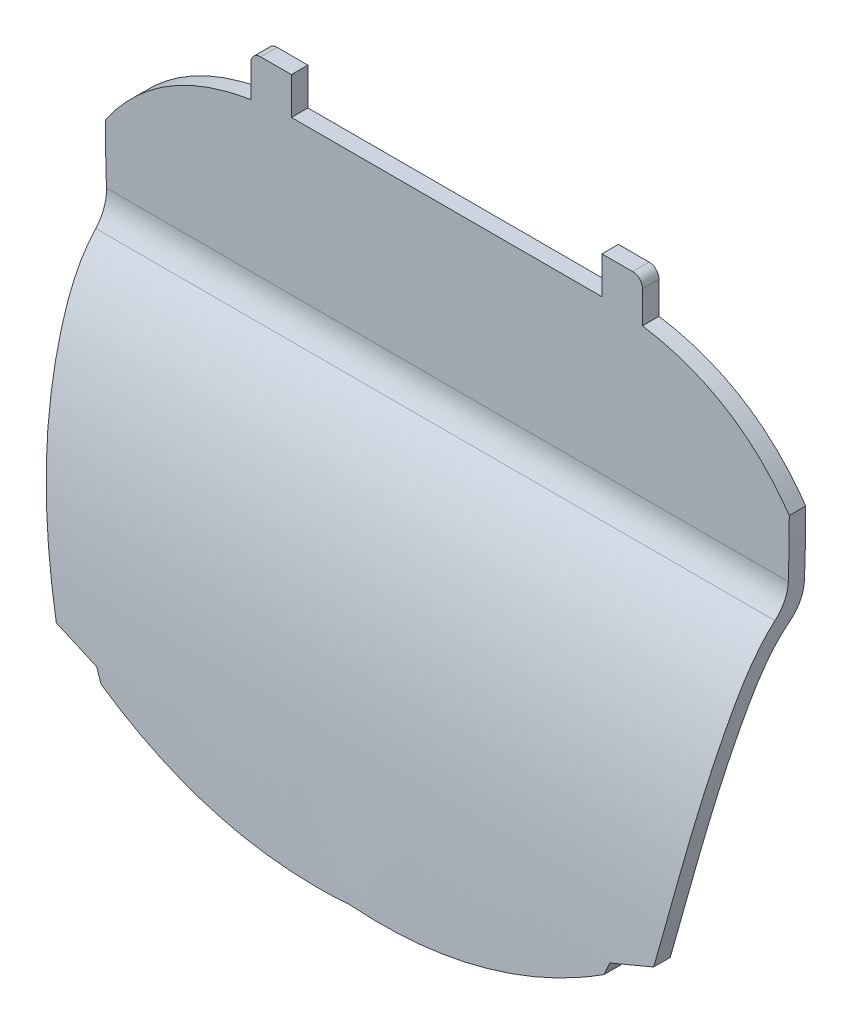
from build123d import *

# Parameters (mm, degrees)
BOSS_EXTRU_1_DEPTH      = 30
BOSS_EXTRU_1_DEPTH_BACK = 90
CONG_1_R                = 6
ESQUISSE2_OUTSIDE_W     = 153.178
ESQUISSE2_OUTSIDE_H     = 131.129
ENL_V_MAT_EXTRU_2_DEPTH = 111.926813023
CONG_2_R                = 6


with BuildPart() as part:
    # Esquisse1 → Boss.-Extru.1 (new, two sides: drawn at the far end of the back side and taken through both)
    with BuildSketch(Plane(origin=(0, 0, 0), x_dir=(0, 0, -1), z_dir=(1, 0, 0)).offset(-BOSS_EXTRU_1_DEPTH_BACK)):
        with BuildLine():
            Line((-36.315484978, 25.975656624), (-36.315484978, 28.707060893))
            Line((-36.315484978, 28.707060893), (-36.315484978, 62.439627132))
            Line((-36.315484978, 62.439627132), (-33.815484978, 62.439627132))
            Line((-33.815484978, 62.439627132), (-33.815484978, 28.707060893))
            Line((-33.815484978, 28.707060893), (-33.815484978, 24.613344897))
            add(Edge.make_bspline(
                [(-48.815484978, -35.511316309), (-47.699394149, -19.001552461), (-48.149105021, 2.132678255), (-37.907823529, 22.269267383), (-33.815484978, 24.613344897)],
                knots=[0, 0, 0, 0, 0.779502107, 1, 1, 1, 1], degree=3))
            Line((-48.815484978, -35.511316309), (-51.309791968, -35.511316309))
            Line((-51.309791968, -35.511316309), (-51.309791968, -35.342696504))
            add(Edge.make_bspline(
                [(-51.309791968, -35.342696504), (-51.135427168, -32.76340672), (-50.858902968, -27.609943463), (-50.471962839, -19.82017945), (-49.927234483, -12.007116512), (-49.033084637, -4.178085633), (-47.832915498, 2.345248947), (-46.502808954, 7.551086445), (-45.290393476, 11.448808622), (-43.860008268, 15.32156796), (-42.092133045, 19.243830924), (-40.118694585, 22.337106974), (-38.11707594, 24.542554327), (-36.935064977, 25.532839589), (-36.315484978, 25.975656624)],
                knots=[0, 0, 0, 0, 0.122555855, 0.24511171, 0.367667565, 0.49022342, 0.612779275, 0.674057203, 0.73533513, 0.796613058, 0.857890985, 0.919168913, 0.949807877, 0.980446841, 0.980446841, 0.980446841, 0.980446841], degree=3))
        make_face()
    extrude(amount=BOSS_EXTRU_1_DEPTH + BOSS_EXTRU_1_DEPTH_BACK)

    # Cong_1
    cong_1_edges = [part.edges().sort_by_distance(p)[0] for p in [
        (-45, 24.613344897, 33.815484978),
    ]]
    fillet(cong_1_edges, radius=CONG_1_R)

    # Esquisse2 outside → Enl_v. mat.-Extru.2 (cut, through all)
    with BuildSketch(Plane(origin=(0, 0, 33.815484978), x_dir=(-1, 0, 0), z_dir=(0, 0, -1))):
        with Locations((30, 13.4645)):
            Rectangle(ESQUISSE2_OUTSIDE_W, ESQUISSE2_OUTSIDE_H)
        with BuildLine():
            Line((52.186235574, 52.073624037), (5.058104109, 52.073624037))
            Line((5.058104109, 52.073624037), (5.058104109, 57.707060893))
            Line((5.058104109, 57.707060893), (0.390945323, 57.707060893))
            ThreePointArc((0.390945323, 57.707060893), (-0.669714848, 57.267721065), (-1.109054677, 56.207060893))
            Line((-1.109054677, 56.207060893), (-1.109054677, 51.336821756))
            add(Edge.make_bspline(
                [(-1.109054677, 51.336821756), (-1.707479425, 51.240333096), (-2.910498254, 51.019250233), (-5.21272537, 50.486337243), (-7.957286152, 49.641909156), (-11.027009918, 48.349452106), (-13.88800034, 46.77734967), (-16.549585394, 44.922274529), (-19.020644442, 42.778475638), (-20.928332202, 40.741086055), (-22.360429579, 38.962484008), (-23.052822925, 38.011785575), (-23.38524998, 37.532223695)],
                knots=[0.499050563, 0.499050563, 0.499050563, 0.499050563, 0.499157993, 0.499265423, 0.499480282, 0.499695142, 0.499910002, 0.500124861, 0.500339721, 0.50055458, 0.50066201, 0.50076944, 0.50076944, 0.50076944, 0.50076944], degree=3))
            add(Edge.make_bspline(
                [(-23.38524998, 37.532223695), (-23.389933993, 32.84958531), (-23.12380866, 23.468816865), (-21.897006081, 9.524641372), (-19.846157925, -4.327795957), (-17.920463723, -13.530741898), (-16.826092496, -18.091013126)],
                knots=[0.49939614, 0.49939614, 0.49939614, 0.49939614, 0.499720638, 0.500045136, 0.500369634, 0.500694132, 0.500694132, 0.500694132, 0.500694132], degree=3))
            Line((-16.826092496, -18.091013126), (-10.313500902, -20.734647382))
            Line((-10.313500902, -20.734647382), (-9.560279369, -22.587226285))
            add(Edge.make_bspline(
                [(-9.560279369, -22.587226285), (-8.828318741, -23.046900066), (-7.340474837, -23.943662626), (-4.356090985, -25.592667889), (-0.568568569, -27.4092968), (4.057724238, -29.193349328), (8.772861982, -30.586428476), (13.579067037, -31.589967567), (18.486934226, -32.204473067), (23.480981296, -32.430843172), (26.920925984, -32.318456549), (28.622169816, -32.199338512)],
                knots=[0.499058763, 0.499058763, 0.499058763, 0.499058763, 0.499172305, 0.499285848, 0.499512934, 0.499740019, 0.499967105, 0.50019419, 0.500421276, 0.500648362, 0.500875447, 0.500875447, 0.500875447, 0.500875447], degree=3))
            add(Edge.make_bspline(
                [(28.622169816, -32.199338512), (29.479764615, -32.262117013), (31.2052552, -32.355979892), (34.598515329, -32.410067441), (38.778744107, -32.231190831), (43.686754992, -31.62274716), (48.495185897, -30.621379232), (53.20830479, -29.22615381), (57.830182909, -27.435751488), (61.611758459, -25.610218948), (64.590070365, -23.951955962), (66.074533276, -23.049724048), (66.804618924, -22.587226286)],
                knots=[0.499102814, 0.499102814, 0.499102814, 0.499102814, 0.499217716, 0.499332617, 0.49956242, 0.499792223, 0.500022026, 0.500251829, 0.500481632, 0.500711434, 0.500826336, 0.500941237, 0.500941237, 0.500941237, 0.500941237], degree=3))
            Line((66.804618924, -22.587226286), (67.557840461, -20.734647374))
            Line((67.557840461, -20.734647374), (73.850003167, -18.180491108))
            add(Edge.make_bspline(
                [(73.850003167, -18.180491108), (74.94742064, -13.602071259), (76.878155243, -4.3625769), (78.933271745, 9.544643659), (80.161091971, 23.543737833), (80.425712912, 32.961300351), (80.419739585, 37.662268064)],
                knots=[0.499305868, 0.499305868, 0.499305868, 0.499305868, 0.499630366, 0.499954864, 0.500279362, 0.50060386, 0.50060386, 0.50060386, 0.50060386], degree=3))
            add(Edge.make_bspline(
                [(80.419739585, 37.662268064), (80.090444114, 38.137312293), (79.404573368, 39.079054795), (77.985966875, 40.840901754), (76.096250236, 42.859098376), (73.648469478, 44.982701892), (71.01195754, 46.820301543), (68.177918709, 48.377594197), (65.13711288, 49.657875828), (62.418406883, 50.494349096), (60.137867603, 51.022241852), (58.94618166, 51.241242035), (58.353394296, 51.336821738)],
                knots=[0.49923056, 0.49923056, 0.49923056, 0.49923056, 0.49933799, 0.49944542, 0.499660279, 0.499875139, 0.500089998, 0.500304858, 0.500519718, 0.500734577, 0.500842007, 0.500949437, 0.500949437, 0.500949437, 0.500949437], degree=3))
            Line((58.353394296, 51.336821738), (58.353394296, 56.207060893))
            ThreePointArc((58.353394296, 56.207060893), (57.914054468, 57.267721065), (56.853394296, 57.707060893))
            Line((56.853394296, 57.707060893), (52.186235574, 57.707060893))
            Line((52.186235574, 57.707060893), (52.186235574, 52.073624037))
        make_face(mode=Mode.SUBTRACT)
    extrude(amount=-ENL_V_MAT_EXTRU_2_DEPTH, mode=Mode.SUBTRACT)

    # Cong_2
    cong_2_edges = [part.edges().sort_by_distance(p)[0] for p in [
        (-40.074791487, 25.975656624, 36.315484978),
    ]]
    fillet(cong_2_edges, radius=CONG_2_R)


solid = part.part
